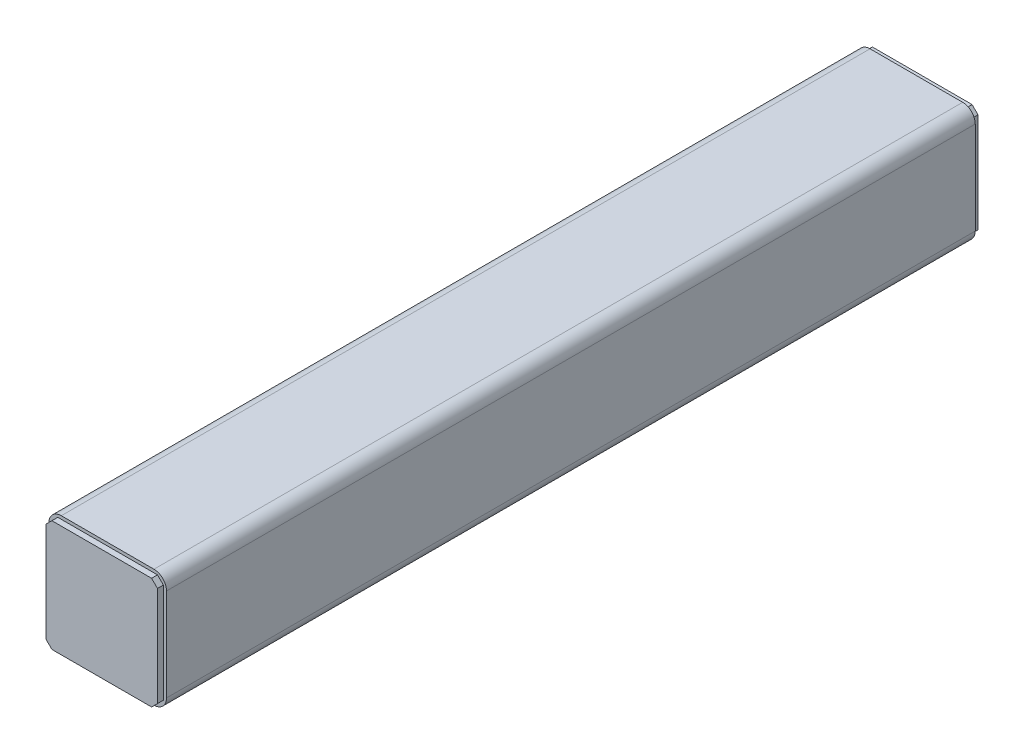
ISO-10303-21;
HEADER;
FILE_DESCRIPTION(('STEP AP214'),'2;1');
FILE_NAME('part.step','',(''),(''),'','','');
FILE_SCHEMA(('AUTOMOTIVE_DESIGN { 1 0 10303 214 1 1 1 1 }'));
ENDSEC;
DATA;
#1=APPLICATION_CONTEXT('core data for automotive mechanical design processes');
#2=APPLICATION_PROTOCOL_DEFINITION('international standard','automotive_design',2000,#1);
#3=PRODUCT_CONTEXT('',#1,'mechanical');
#4=PRODUCT('Part','Part','',(#3));
#5=PRODUCT_RELATED_PRODUCT_CATEGORY('part','',(#4));
#6=PRODUCT_DEFINITION_FORMATION('','',#4);
#7=PRODUCT_DEFINITION_CONTEXT('part definition',#1,'design');
#8=PRODUCT_DEFINITION('design','',#6,#7);
#9=PRODUCT_DEFINITION_SHAPE('','',#8);
#10=(LENGTH_UNIT() NAMED_UNIT(*) SI_UNIT(.MILLI.,.METRE.));
#11=(NAMED_UNIT(*) PLANE_ANGLE_UNIT() SI_UNIT($,.RADIAN.));
#12=(NAMED_UNIT(*) SI_UNIT($,.STERADIAN.) SOLID_ANGLE_UNIT());
#13=UNCERTAINTY_MEASURE_WITH_UNIT(LENGTH_MEASURE(1.E-05),#10,'distance_accuracy_value','');
#14=(GEOMETRIC_REPRESENTATION_CONTEXT(3) GLOBAL_UNCERTAINTY_ASSIGNED_CONTEXT((#13)) GLOBAL_UNIT_ASSIGNED_CONTEXT((#10,
#11,#12)) REPRESENTATION_CONTEXT('',''));
#15=CARTESIAN_POINT('',(0.,0.,0.));
#16=DIRECTION('',(0.,0.,1.));
#17=DIRECTION('',(1.,0.,0.));
#18=AXIS2_PLACEMENT_3D('',#15,#16,#17);
#19=CARTESIAN_POINT('',(28.4,25.4,-3.));
#20=DIRECTION('',(0.707106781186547,0.707106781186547,0.));
#21=DIRECTION('',(-0.707106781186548,0.707106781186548,0.));
#22=AXIS2_PLACEMENT_3D('',#19,#20,#21);
#23=PLANE('',#22);
#24=DIRECTION('',(-0.707106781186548,0.707106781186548,0.));
#25=VECTOR('',#24,1.);
#26=CARTESIAN_POINT('',(28.4,25.4,0.));
#27=LINE('',#26,#25);
#28=CARTESIAN_POINT('',(28.4,25.4,0.));
#29=VERTEX_POINT('',#28);
#30=CARTESIAN_POINT('',(25.4,28.4,0.));
#31=VERTEX_POINT('',#30);
#32=EDGE_CURVE('E192',#29,#31,#27,.T.);
#33=ORIENTED_EDGE('',*,*,#32,.F.);
#34=DIRECTION('',(0.,0.,1.));
#35=VECTOR('',#34,1.);
#36=CARTESIAN_POINT('',(28.4,25.4,-3.));
#37=LINE('',#36,#35);
#38=CARTESIAN_POINT('',(28.4,25.4,-3.));
#39=VERTEX_POINT('',#38);
#40=EDGE_CURVE('E13',#39,#29,#37,.T.);
#41=ORIENTED_EDGE('',*,*,#40,.F.);
#42=DIRECTION('',(-0.707106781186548,0.707106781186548,0.));
#43=VECTOR('',#42,1.);
#44=CARTESIAN_POINT('',(28.4,25.4,-3.));
#45=LINE('',#44,#43);
#46=CARTESIAN_POINT('',(25.4,28.4,-3.));
#47=VERTEX_POINT('',#46);
#48=EDGE_CURVE('E212',#39,#47,#45,.T.);
#49=ORIENTED_EDGE('',*,*,#48,.T.);
#50=DIRECTION('',(0.,0.,1.));
#51=VECTOR('',#50,1.);
#52=CARTESIAN_POINT('',(25.4,28.4,-3.));
#53=LINE('',#52,#51);
#54=EDGE_CURVE('E98',#47,#31,#53,.T.);
#55=ORIENTED_EDGE('',*,*,#54,.T.);
#56=EDGE_LOOP('',(#33,#41,#49,#55));
#57=FACE_BOUND('',#56,.T.);
#58=ADVANCED_FACE('F95',(#57),#23,.T.);
#59=CARTESIAN_POINT('',(28.4,-25.4,-3.));
#60=DIRECTION('',(1.,0.,0.));
#61=DIRECTION('',(0.,1.,0.));
#62=AXIS2_PLACEMENT_3D('',#59,#60,#61);
#63=PLANE('',#62);
#64=DIRECTION('',(0.,1.,0.));
#65=VECTOR('',#64,1.);
#66=CARTESIAN_POINT('',(28.4,-25.4,0.));
#67=LINE('',#66,#65);
#68=CARTESIAN_POINT('',(28.4,-25.4,0.));
#69=VERTEX_POINT('',#68);
#70=EDGE_CURVE('E210',#69,#29,#67,.T.);
#71=ORIENTED_EDGE('',*,*,#70,.F.);
#72=DIRECTION('',(0.,0.,1.));
#73=VECTOR('',#72,1.);
#74=CARTESIAN_POINT('',(28.4,-25.4,-3.));
#75=LINE('',#74,#73);
#76=CARTESIAN_POINT('',(28.4,-25.4,-3.));
#77=VERTEX_POINT('',#76);
#78=EDGE_CURVE('E104',#77,#69,#75,.T.);
#79=ORIENTED_EDGE('',*,*,#78,.F.);
#80=DIRECTION('',(0.,1.,0.));
#81=VECTOR('',#80,1.);
#82=CARTESIAN_POINT('',(28.4,-25.4,-3.));
#83=LINE('',#82,#81);
#84=EDGE_CURVE('E182',#77,#39,#83,.T.);
#85=ORIENTED_EDGE('',*,*,#84,.T.);
#86=ORIENTED_EDGE('',*,*,#40,.T.);
#87=EDGE_LOOP('',(#71,#79,#85,#86));
#88=FACE_BOUND('',#87,.T.);
#89=ADVANCED_FACE('F224',(#88),#63,.T.);
#90=CARTESIAN_POINT('',(25.4,-28.4,-3.));
#91=DIRECTION('',(0.707106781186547,-0.707106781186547,0.));
#92=DIRECTION('',(0.707106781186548,0.707106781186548,0.));
#93=AXIS2_PLACEMENT_3D('',#90,#91,#92);
#94=PLANE('',#93);
#95=DIRECTION('',(0.707106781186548,0.707106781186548,0.));
#96=VECTOR('',#95,1.);
#97=CARTESIAN_POINT('',(25.4,-28.4,0.));
#98=LINE('',#97,#96);
#99=CARTESIAN_POINT('',(25.4,-28.4,0.));
#100=VERTEX_POINT('',#99);
#101=EDGE_CURVE('E169',#100,#69,#98,.T.);
#102=ORIENTED_EDGE('',*,*,#101,.F.);
#103=DIRECTION('',(0.,0.,1.));
#104=VECTOR('',#103,1.);
#105=CARTESIAN_POINT('',(25.4,-28.4,-3.));
#106=LINE('',#105,#104);
#107=CARTESIAN_POINT('',(25.4,-28.4,-3.));
#108=VERTEX_POINT('',#107);
#109=EDGE_CURVE('E164',#108,#100,#106,.T.);
#110=ORIENTED_EDGE('',*,*,#109,.F.);
#111=DIRECTION('',(0.707106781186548,0.707106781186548,0.));
#112=VECTOR('',#111,1.);
#113=CARTESIAN_POINT('',(25.4,-28.4,-3.));
#114=LINE('',#113,#112);
#115=EDGE_CURVE('E167',#108,#77,#114,.T.);
#116=ORIENTED_EDGE('',*,*,#115,.T.);
#117=ORIENTED_EDGE('',*,*,#78,.T.);
#118=EDGE_LOOP('',(#102,#110,#116,#117));
#119=FACE_BOUND('',#118,.T.);
#120=ADVANCED_FACE('F166',(#119),#94,.T.);
#121=CARTESIAN_POINT('',(-25.4,-28.4,-3.));
#122=DIRECTION('',(0.,-1.,0.));
#123=DIRECTION('',(1.,0.,0.));
#124=AXIS2_PLACEMENT_3D('',#121,#122,#123);
#125=PLANE('',#124);
#126=DIRECTION('',(1.,0.,0.));
#127=VECTOR('',#126,1.);
#128=CARTESIAN_POINT('',(-25.4,-28.4,0.));
#129=LINE('',#128,#127);
#130=CARTESIAN_POINT('',(-25.4,-28.4,0.));
#131=VERTEX_POINT('',#130);
#132=EDGE_CURVE('E207',#131,#100,#129,.T.);
#133=ORIENTED_EDGE('',*,*,#132,.F.);
#134=DIRECTION('',(0.,0.,1.));
#135=VECTOR('',#134,1.);
#136=CARTESIAN_POINT('',(-25.4,-28.4,-3.));
#137=LINE('',#136,#135);
#138=CARTESIAN_POINT('',(-25.4,-28.4,-3.));
#139=VERTEX_POINT('',#138);
#140=EDGE_CURVE('E174',#139,#131,#137,.T.);
#141=ORIENTED_EDGE('',*,*,#140,.F.);
#142=DIRECTION('',(1.,0.,0.));
#143=VECTOR('',#142,1.);
#144=CARTESIAN_POINT('',(-25.4,-28.4,-3.));
#145=LINE('',#144,#143);
#146=EDGE_CURVE('E180',#139,#108,#145,.T.);
#147=ORIENTED_EDGE('',*,*,#146,.T.);
#148=ORIENTED_EDGE('',*,*,#109,.T.);
#149=EDGE_LOOP('',(#133,#141,#147,#148));
#150=FACE_BOUND('',#149,.T.);
#151=ADVANCED_FACE('F184',(#150),#125,.T.);
#152=CARTESIAN_POINT('',(-28.4,-25.4,-3.));
#153=DIRECTION('',(-0.707106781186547,-0.707106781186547,0.));
#154=DIRECTION('',(0.707106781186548,-0.707106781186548,0.));
#155=AXIS2_PLACEMENT_3D('',#152,#153,#154);
#156=PLANE('',#155);
#157=DIRECTION('',(0.707106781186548,-0.707106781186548,0.));
#158=VECTOR('',#157,1.);
#159=CARTESIAN_POINT('',(-28.4,-25.4,0.));
#160=LINE('',#159,#158);
#161=CARTESIAN_POINT('',(-28.4,-25.4,0.));
#162=VERTEX_POINT('',#161);
#163=EDGE_CURVE('E204',#162,#131,#160,.T.);
#164=ORIENTED_EDGE('',*,*,#163,.F.);
#165=DIRECTION('',(0.,0.,1.));
#166=VECTOR('',#165,1.);
#167=CARTESIAN_POINT('',(-28.4,-25.4,-3.));
#168=LINE('',#167,#166);
#169=CARTESIAN_POINT('',(-28.4,-25.4,-3.));
#170=VERTEX_POINT('',#169);
#171=EDGE_CURVE('E216',#170,#162,#168,.T.);
#172=ORIENTED_EDGE('',*,*,#171,.F.);
#173=DIRECTION('',(0.707106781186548,-0.707106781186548,0.));
#174=VECTOR('',#173,1.);
#175=CARTESIAN_POINT('',(-28.4,-25.4,-3.));
#176=LINE('',#175,#174);
#177=EDGE_CURVE('E185',#170,#139,#176,.T.);
#178=ORIENTED_EDGE('',*,*,#177,.T.);
#179=ORIENTED_EDGE('',*,*,#140,.T.);
#180=EDGE_LOOP('',(#164,#172,#178,#179));
#181=FACE_BOUND('',#180,.T.);
#182=ADVANCED_FACE('F237',(#181),#156,.T.);
#183=CARTESIAN_POINT('',(-28.4,25.4,-3.));
#184=DIRECTION('',(-1.,0.,0.));
#185=DIRECTION('',(0.,-1.,0.));
#186=AXIS2_PLACEMENT_3D('',#183,#184,#185);
#187=PLANE('',#186);
#188=DIRECTION('',(0.,-1.,0.));
#189=VECTOR('',#188,1.);
#190=CARTESIAN_POINT('',(-28.4,25.4,0.));
#191=LINE('',#190,#189);
#192=CARTESIAN_POINT('',(-28.4,25.4,0.));
#193=VERTEX_POINT('',#192);
#194=EDGE_CURVE('E201',#193,#162,#191,.T.);
#195=ORIENTED_EDGE('',*,*,#194,.F.);
#196=DIRECTION('',(0.,0.,1.));
#197=VECTOR('',#196,1.);
#198=CARTESIAN_POINT('',(-28.4,25.4,-3.));
#199=LINE('',#198,#197);
#200=CARTESIAN_POINT('',(-28.4,25.4,-3.));
#201=VERTEX_POINT('',#200);
#202=EDGE_CURVE('E218',#201,#193,#199,.T.);
#203=ORIENTED_EDGE('',*,*,#202,.F.);
#204=DIRECTION('',(0.,-1.,0.));
#205=VECTOR('',#204,1.);
#206=CARTESIAN_POINT('',(-28.4,25.4,-3.));
#207=LINE('',#206,#205);
#208=EDGE_CURVE('E187',#201,#170,#207,.T.);
#209=ORIENTED_EDGE('',*,*,#208,.T.);
#210=ORIENTED_EDGE('',*,*,#171,.T.);
#211=EDGE_LOOP('',(#195,#203,#209,#210));
#212=FACE_BOUND('',#211,.T.);
#213=ADVANCED_FACE('F240',(#212),#187,.T.);
#214=CARTESIAN_POINT('',(-25.4,28.4,-3.));
#215=DIRECTION('',(-0.707106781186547,0.707106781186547,0.));
#216=DIRECTION('',(-0.707106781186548,-0.707106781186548,0.));
#217=AXIS2_PLACEMENT_3D('',#214,#215,#216);
#218=PLANE('',#217);
#219=DIRECTION('',(-0.707106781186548,-0.707106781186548,0.));
#220=VECTOR('',#219,1.);
#221=CARTESIAN_POINT('',(-25.4,28.4,0.));
#222=LINE('',#221,#220);
#223=CARTESIAN_POINT('',(-25.4,28.4,0.));
#224=VERTEX_POINT('',#223);
#225=EDGE_CURVE('E198',#224,#193,#222,.T.);
#226=ORIENTED_EDGE('',*,*,#225,.F.);
#227=DIRECTION('',(0.,0.,1.));
#228=VECTOR('',#227,1.);
#229=CARTESIAN_POINT('',(-25.4,28.4,-3.));
#230=LINE('',#229,#228);
#231=CARTESIAN_POINT('',(-25.4,28.4,-3.));
#232=VERTEX_POINT('',#231);
#233=EDGE_CURVE('E219',#232,#224,#230,.T.);
#234=ORIENTED_EDGE('',*,*,#233,.F.);
#235=DIRECTION('',(-0.707106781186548,-0.707106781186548,0.));
#236=VECTOR('',#235,1.);
#237=CARTESIAN_POINT('',(-25.4,28.4,-3.));
#238=LINE('',#237,#236);
#239=EDGE_CURVE('E315',#232,#201,#238,.T.);
#240=ORIENTED_EDGE('',*,*,#239,.T.);
#241=ORIENTED_EDGE('',*,*,#202,.T.);
#242=EDGE_LOOP('',(#226,#234,#240,#241));
#243=FACE_BOUND('',#242,.T.);
#244=ADVANCED_FACE('F244',(#243),#218,.T.);
#245=CARTESIAN_POINT('',(25.4,28.4,-3.));
#246=DIRECTION('',(0.,1.,0.));
#247=DIRECTION('',(-1.,0.,0.));
#248=AXIS2_PLACEMENT_3D('',#245,#246,#247);
#249=PLANE('',#248);
#250=DIRECTION('',(-1.,0.,0.));
#251=VECTOR('',#250,1.);
#252=CARTESIAN_POINT('',(25.4,28.4,0.));
#253=LINE('',#252,#251);
#254=EDGE_CURVE('E195',#31,#224,#253,.T.);
#255=ORIENTED_EDGE('',*,*,#254,.F.);
#256=ORIENTED_EDGE('',*,*,#54,.F.);
#257=DIRECTION('',(-1.,0.,0.));
#258=VECTOR('',#257,1.);
#259=CARTESIAN_POINT('',(25.4,28.4,-3.));
#260=LINE('',#259,#258);
#261=EDGE_CURVE('E316',#47,#232,#260,.T.);
#262=ORIENTED_EDGE('',*,*,#261,.T.);
#263=ORIENTED_EDGE('',*,*,#233,.T.);
#264=EDGE_LOOP('',(#255,#256,#262,#263));
#265=FACE_BOUND('',#264,.T.);
#266=ADVANCED_FACE('F221',(#265),#249,.T.);
#267=CARTESIAN_POINT('',(0.,53.8,-3.));
#268=DIRECTION('',(0.,0.,1.));
#269=DIRECTION('',(1.,0.,0.));
#270=AXIS2_PLACEMENT_3D('',#267,#268,#269);
#271=PLANE('',#270);
#272=ORIENTED_EDGE('',*,*,#48,.F.);
#273=ORIENTED_EDGE('',*,*,#84,.F.);
#274=ORIENTED_EDGE('',*,*,#115,.F.);
#275=ORIENTED_EDGE('',*,*,#146,.F.);
#276=ORIENTED_EDGE('',*,*,#177,.F.);
#277=ORIENTED_EDGE('',*,*,#208,.F.);
#278=ORIENTED_EDGE('',*,*,#239,.F.);
#279=ORIENTED_EDGE('',*,*,#261,.F.);
#280=EDGE_LOOP('',(#272,#273,#274,#275,#276,#277,#278,#279));
#281=FACE_BOUND('',#280,.T.);
#282=ADVANCED_FACE('F178',(#281),#271,.F.);
#283=CARTESIAN_POINT('',(0.,53.8,0.));
#284=DIRECTION('',(0.,0.,1.));
#285=DIRECTION('',(1.,0.,0.));
#286=AXIS2_PLACEMENT_3D('',#283,#284,#285);
#287=PLANE('',#286);
#288=ORIENTED_EDGE('',*,*,#32,.T.);
#289=ORIENTED_EDGE('',*,*,#254,.T.);
#290=ORIENTED_EDGE('',*,*,#225,.T.);
#291=ORIENTED_EDGE('',*,*,#194,.T.);
#292=ORIENTED_EDGE('',*,*,#163,.T.);
#293=ORIENTED_EDGE('',*,*,#132,.T.);
#294=ORIENTED_EDGE('',*,*,#101,.T.);
#295=ORIENTED_EDGE('',*,*,#70,.T.);
#296=EDGE_LOOP('',(#288,#289,#290,#291,#292,#293,#294,#295));
#297=FACE_BOUND('',#296,.T.);
#298=ADVANCED_FACE('F223',(#297),#287,.T.);
#299=CLOSED_SHELL('',(#58,#89,#120,#151,#182,#213,#244,#266,#282,#298));
#300=MANIFOLD_SOLID_BREP('B2',#299);
#301=CARTESIAN_POINT('',(25.4,28.4,-415.));
#302=DIRECTION('',(0.707106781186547,0.707106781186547,0.));
#303=DIRECTION('',(-0.707106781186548,0.707106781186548,0.));
#304=AXIS2_PLACEMENT_3D('',#301,#302,#303);
#305=PLANE('',#304);
#306=DIRECTION('',(0.707106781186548,-0.707106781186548,0.));
#307=VECTOR('',#306,1.);
#308=CARTESIAN_POINT('',(25.4,28.4,-418.));
#309=LINE('',#308,#307);
#310=CARTESIAN_POINT('',(25.4,28.4,-418.));
#311=VERTEX_POINT('',#310);
#312=CARTESIAN_POINT('',(28.4,25.4,-418.));
#313=VERTEX_POINT('',#312);
#314=EDGE_CURVE('E428',#311,#313,#309,.T.);
#315=ORIENTED_EDGE('',*,*,#314,.F.);
#316=DIRECTION('',(0.,0.,-1.));
#317=VECTOR('',#316,1.);
#318=CARTESIAN_POINT('',(25.4,28.4,-415.));
#319=LINE('',#318,#317);
#320=CARTESIAN_POINT('',(25.4,28.4,-415.));
#321=VERTEX_POINT('',#320);
#322=EDGE_CURVE('E93',#321,#311,#319,.T.);
#323=ORIENTED_EDGE('',*,*,#322,.F.);
#324=DIRECTION('',(0.707106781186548,-0.707106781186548,0.));
#325=VECTOR('',#324,1.);
#326=CARTESIAN_POINT('',(25.4,28.4,-415.));
#327=LINE('',#326,#325);
#328=CARTESIAN_POINT('',(28.4,25.4,-415.));
#329=VERTEX_POINT('',#328);
#330=EDGE_CURVE('E448',#321,#329,#327,.T.);
#331=ORIENTED_EDGE('',*,*,#330,.T.);
#332=DIRECTION('',(0.,0.,-1.));
#333=VECTOR('',#332,1.);
#334=CARTESIAN_POINT('',(28.4,25.4,-415.));
#335=LINE('',#334,#333);
#336=EDGE_CURVE('E334',#329,#313,#335,.T.);
#337=ORIENTED_EDGE('',*,*,#336,.T.);
#338=EDGE_LOOP('',(#315,#323,#331,#337));
#339=FACE_BOUND('',#338,.T.);
#340=ADVANCED_FACE('F331',(#339),#305,.T.);
#341=CARTESIAN_POINT('',(-25.4,28.4,-415.));
#342=DIRECTION('',(0.,1.,0.));
#343=DIRECTION('',(-1.,0.,0.));
#344=AXIS2_PLACEMENT_3D('',#341,#342,#343);
#345=PLANE('',#344);
#346=DIRECTION('',(1.,0.,0.));
#347=VECTOR('',#346,1.);
#348=CARTESIAN_POINT('',(-25.4,28.4,-418.));
#349=LINE('',#348,#347);
#350=CARTESIAN_POINT('',(-25.4,28.4,-418.));
#351=VERTEX_POINT('',#350);
#352=EDGE_CURVE('E446',#351,#311,#349,.T.);
#353=ORIENTED_EDGE('',*,*,#352,.F.);
#354=DIRECTION('',(0.,0.,-1.));
#355=VECTOR('',#354,1.);
#356=CARTESIAN_POINT('',(-25.4,28.4,-415.));
#357=LINE('',#356,#355);
#358=CARTESIAN_POINT('',(-25.4,28.4,-415.));
#359=VERTEX_POINT('',#358);
#360=EDGE_CURVE('E340',#359,#351,#357,.T.);
#361=ORIENTED_EDGE('',*,*,#360,.F.);
#362=DIRECTION('',(1.,0.,0.));
#363=VECTOR('',#362,1.);
#364=CARTESIAN_POINT('',(-25.4,28.4,-415.));
#365=LINE('',#364,#363);
#366=EDGE_CURVE('E418',#359,#321,#365,.T.);
#367=ORIENTED_EDGE('',*,*,#366,.T.);
#368=ORIENTED_EDGE('',*,*,#322,.T.);
#369=EDGE_LOOP('',(#353,#361,#367,#368));
#370=FACE_BOUND('',#369,.T.);
#371=ADVANCED_FACE('F460',(#370),#345,.T.);
#372=CARTESIAN_POINT('',(-28.4,25.4,-415.));
#373=DIRECTION('',(-0.707106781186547,0.707106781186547,0.));
#374=DIRECTION('',(-0.707106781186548,-0.707106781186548,0.));
#375=AXIS2_PLACEMENT_3D('',#372,#373,#374);
#376=PLANE('',#375);
#377=DIRECTION('',(0.707106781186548,0.707106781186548,0.));
#378=VECTOR('',#377,1.);
#379=CARTESIAN_POINT('',(-28.4,25.4,-418.));
#380=LINE('',#379,#378);
#381=CARTESIAN_POINT('',(-28.4,25.4,-418.));
#382=VERTEX_POINT('',#381);
#383=EDGE_CURVE('E405',#382,#351,#380,.T.);
#384=ORIENTED_EDGE('',*,*,#383,.F.);
#385=DIRECTION('',(0.,0.,-1.));
#386=VECTOR('',#385,1.);
#387=CARTESIAN_POINT('',(-28.4,25.4,-415.));
#388=LINE('',#387,#386);
#389=CARTESIAN_POINT('',(-28.4,25.4,-415.));
#390=VERTEX_POINT('',#389);
#391=EDGE_CURVE('E400',#390,#382,#388,.T.);
#392=ORIENTED_EDGE('',*,*,#391,.F.);
#393=DIRECTION('',(0.707106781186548,0.707106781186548,0.));
#394=VECTOR('',#393,1.);
#395=CARTESIAN_POINT('',(-28.4,25.4,-415.));
#396=LINE('',#395,#394);
#397=EDGE_CURVE('E403',#390,#359,#396,.T.);
#398=ORIENTED_EDGE('',*,*,#397,.T.);
#399=ORIENTED_EDGE('',*,*,#360,.T.);
#400=EDGE_LOOP('',(#384,#392,#398,#399));
#401=FACE_BOUND('',#400,.T.);
#402=ADVANCED_FACE('F402',(#401),#376,.T.);
#403=CARTESIAN_POINT('',(-28.4,-25.4,-415.));
#404=DIRECTION('',(-1.,0.,0.));
#405=DIRECTION('',(0.,0.,1.));
#406=AXIS2_PLACEMENT_3D('',#403,#404,#405);
#407=PLANE('',#406);
#408=DIRECTION('',(0.,1.,0.));
#409=VECTOR('',#408,1.);
#410=CARTESIAN_POINT('',(-28.4,-25.4,-418.));
#411=LINE('',#410,#409);
#412=CARTESIAN_POINT('',(-28.4,-25.4,-418.));
#413=VERTEX_POINT('',#412);
#414=EDGE_CURVE('E443',#413,#382,#411,.T.);
#415=ORIENTED_EDGE('',*,*,#414,.F.);
#416=DIRECTION('',(0.,0.,-1.));
#417=VECTOR('',#416,1.);
#418=CARTESIAN_POINT('',(-28.4,-25.4,-415.));
#419=LINE('',#418,#417);
#420=CARTESIAN_POINT('',(-28.4,-25.4,-415.));
#421=VERTEX_POINT('',#420);
#422=EDGE_CURVE('E410',#421,#413,#419,.T.);
#423=ORIENTED_EDGE('',*,*,#422,.F.);
#424=DIRECTION('',(0.,1.,0.));
#425=VECTOR('',#424,1.);
#426=CARTESIAN_POINT('',(-28.4,-25.4,-415.));
#427=LINE('',#426,#425);
#428=EDGE_CURVE('E416',#421,#390,#427,.T.);
#429=ORIENTED_EDGE('',*,*,#428,.T.);
#430=ORIENTED_EDGE('',*,*,#391,.T.);
#431=EDGE_LOOP('',(#415,#423,#429,#430));
#432=FACE_BOUND('',#431,.T.);
#433=ADVANCED_FACE('F420',(#432),#407,.T.);
#434=CARTESIAN_POINT('',(-25.4,-28.4,-415.));
#435=DIRECTION('',(-0.707106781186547,-0.707106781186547,0.));
#436=DIRECTION('',(0.707106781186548,-0.707106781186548,0.));
#437=AXIS2_PLACEMENT_3D('',#434,#435,#436);
#438=PLANE('',#437);
#439=DIRECTION('',(-0.707106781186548,0.707106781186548,0.));
#440=VECTOR('',#439,1.);
#441=CARTESIAN_POINT('',(-25.4,-28.4,-418.));
#442=LINE('',#441,#440);
#443=CARTESIAN_POINT('',(-25.4,-28.4,-418.));
#444=VERTEX_POINT('',#443);
#445=EDGE_CURVE('E440',#444,#413,#442,.T.);
#446=ORIENTED_EDGE('',*,*,#445,.F.);
#447=DIRECTION('',(0.,0.,-1.));
#448=VECTOR('',#447,1.);
#449=CARTESIAN_POINT('',(-25.4,-28.4,-415.));
#450=LINE('',#449,#448);
#451=CARTESIAN_POINT('',(-25.4,-28.4,-415.));
#452=VERTEX_POINT('',#451);
#453=EDGE_CURVE('E452',#452,#444,#450,.T.);
#454=ORIENTED_EDGE('',*,*,#453,.F.);
#455=DIRECTION('',(-0.707106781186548,0.707106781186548,0.));
#456=VECTOR('',#455,1.);
#457=CARTESIAN_POINT('',(-25.4,-28.4,-415.));
#458=LINE('',#457,#456);
#459=EDGE_CURVE('E421',#452,#421,#458,.T.);
#460=ORIENTED_EDGE('',*,*,#459,.T.);
#461=ORIENTED_EDGE('',*,*,#422,.T.);
#462=EDGE_LOOP('',(#446,#454,#460,#461));
#463=FACE_BOUND('',#462,.T.);
#464=ADVANCED_FACE('F473',(#463),#438,.T.);
#465=CARTESIAN_POINT('',(25.4,-28.4,-415.));
#466=DIRECTION('',(0.,-1.,0.));
#467=DIRECTION('',(1.,0.,0.));
#468=AXIS2_PLACEMENT_3D('',#465,#466,#467);
#469=PLANE('',#468);
#470=DIRECTION('',(-1.,0.,0.));
#471=VECTOR('',#470,1.);
#472=CARTESIAN_POINT('',(25.4,-28.4,-418.));
#473=LINE('',#472,#471);
#474=CARTESIAN_POINT('',(25.4,-28.4,-418.));
#475=VERTEX_POINT('',#474);
#476=EDGE_CURVE('E437',#475,#444,#473,.T.);
#477=ORIENTED_EDGE('',*,*,#476,.F.);
#478=DIRECTION('',(0.,0.,-1.));
#479=VECTOR('',#478,1.);
#480=CARTESIAN_POINT('',(25.4,-28.4,-415.));
#481=LINE('',#480,#479);
#482=CARTESIAN_POINT('',(25.4,-28.4,-415.));
#483=VERTEX_POINT('',#482);
#484=EDGE_CURVE('E454',#483,#475,#481,.T.);
#485=ORIENTED_EDGE('',*,*,#484,.F.);
#486=DIRECTION('',(-1.,0.,0.));
#487=VECTOR('',#486,1.);
#488=CARTESIAN_POINT('',(25.4,-28.4,-415.));
#489=LINE('',#488,#487);
#490=EDGE_CURVE('E423',#483,#452,#489,.T.);
#491=ORIENTED_EDGE('',*,*,#490,.T.);
#492=ORIENTED_EDGE('',*,*,#453,.T.);
#493=EDGE_LOOP('',(#477,#485,#491,#492));
#494=FACE_BOUND('',#493,.T.);
#495=ADVANCED_FACE('F476',(#494),#469,.T.);
#496=CARTESIAN_POINT('',(28.4,-25.4,-415.));
#497=DIRECTION('',(0.707106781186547,-0.707106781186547,0.));
#498=DIRECTION('',(0.707106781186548,0.707106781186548,0.));
#499=AXIS2_PLACEMENT_3D('',#496,#497,#498);
#500=PLANE('',#499);
#501=DIRECTION('',(-0.707106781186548,-0.707106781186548,0.));
#502=VECTOR('',#501,1.);
#503=CARTESIAN_POINT('',(28.4,-25.4,-418.));
#504=LINE('',#503,#502);
#505=CARTESIAN_POINT('',(28.4,-25.4,-418.));
#506=VERTEX_POINT('',#505);
#507=EDGE_CURVE('E434',#506,#475,#504,.T.);
#508=ORIENTED_EDGE('',*,*,#507,.F.);
#509=DIRECTION('',(0.,0.,-1.));
#510=VECTOR('',#509,1.);
#511=CARTESIAN_POINT('',(28.4,-25.4,-415.));
#512=LINE('',#511,#510);
#513=CARTESIAN_POINT('',(28.4,-25.4,-415.));
#514=VERTEX_POINT('',#513);
#515=EDGE_CURVE('E455',#514,#506,#512,.T.);
#516=ORIENTED_EDGE('',*,*,#515,.F.);
#517=DIRECTION('',(-0.707106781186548,-0.707106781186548,0.));
#518=VECTOR('',#517,1.);
#519=CARTESIAN_POINT('',(28.4,-25.4,-415.));
#520=LINE('',#519,#518);
#521=EDGE_CURVE('E551',#514,#483,#520,.T.);
#522=ORIENTED_EDGE('',*,*,#521,.T.);
#523=ORIENTED_EDGE('',*,*,#484,.T.);
#524=EDGE_LOOP('',(#508,#516,#522,#523));
#525=FACE_BOUND('',#524,.T.);
#526=ADVANCED_FACE('F480',(#525),#500,.T.);
#527=CARTESIAN_POINT('',(28.4,25.4,-415.));
#528=DIRECTION('',(1.,0.,0.));
#529=DIRECTION('',(0.,1.,0.));
#530=AXIS2_PLACEMENT_3D('',#527,#528,#529);
#531=PLANE('',#530);
#532=DIRECTION('',(0.,-1.,0.));
#533=VECTOR('',#532,1.);
#534=CARTESIAN_POINT('',(28.4,25.4,-418.));
#535=LINE('',#534,#533);
#536=EDGE_CURVE('E431',#313,#506,#535,.T.);
#537=ORIENTED_EDGE('',*,*,#536,.F.);
#538=ORIENTED_EDGE('',*,*,#336,.F.);
#539=DIRECTION('',(0.,-1.,0.));
#540=VECTOR('',#539,1.);
#541=CARTESIAN_POINT('',(28.4,25.4,-415.));
#542=LINE('',#541,#540);
#543=EDGE_CURVE('E552',#329,#514,#542,.T.);
#544=ORIENTED_EDGE('',*,*,#543,.T.);
#545=ORIENTED_EDGE('',*,*,#515,.T.);
#546=EDGE_LOOP('',(#537,#538,#544,#545));
#547=FACE_BOUND('',#546,.T.);
#548=ADVANCED_FACE('F457',(#547),#531,.T.);
#549=CARTESIAN_POINT('',(53.8,0.,-415.));
#550=DIRECTION('',(0.,0.,-1.));
#551=DIRECTION('',(-1.,0.,0.));
#552=AXIS2_PLACEMENT_3D('',#549,#550,#551);
#553=PLANE('',#552);
#554=ORIENTED_EDGE('',*,*,#330,.F.);
#555=ORIENTED_EDGE('',*,*,#366,.F.);
#556=ORIENTED_EDGE('',*,*,#397,.F.);
#557=ORIENTED_EDGE('',*,*,#428,.F.);
#558=ORIENTED_EDGE('',*,*,#459,.F.);
#559=ORIENTED_EDGE('',*,*,#490,.F.);
#560=ORIENTED_EDGE('',*,*,#521,.F.);
#561=ORIENTED_EDGE('',*,*,#543,.F.);
#562=EDGE_LOOP('',(#554,#555,#556,#557,#558,#559,#560,#561));
#563=FACE_BOUND('',#562,.T.);
#564=ADVANCED_FACE('F414',(#563),#553,.F.);
#565=CARTESIAN_POINT('',(53.8,0.,-418.));
#566=DIRECTION('',(0.,0.,-1.));
#567=DIRECTION('',(-1.,0.,0.));
#568=AXIS2_PLACEMENT_3D('',#565,#566,#567);
#569=PLANE('',#568);
#570=ORIENTED_EDGE('',*,*,#314,.T.);
#571=ORIENTED_EDGE('',*,*,#536,.T.);
#572=ORIENTED_EDGE('',*,*,#507,.T.);
#573=ORIENTED_EDGE('',*,*,#476,.T.);
#574=ORIENTED_EDGE('',*,*,#445,.T.);
#575=ORIENTED_EDGE('',*,*,#414,.T.);
#576=ORIENTED_EDGE('',*,*,#383,.T.);
#577=ORIENTED_EDGE('',*,*,#352,.T.);
#578=EDGE_LOOP('',(#570,#571,#572,#573,#574,#575,#576,#577));
#579=FACE_BOUND('',#578,.T.);
#580=ADVANCED_FACE('F459',(#579),#569,.T.);
#581=CLOSED_SHELL('',(#340,#371,#402,#433,#464,#495,#526,#548,#564,#580));
#582=MANIFOLD_SOLID_BREP('B7',#581);
#583=CARTESIAN_POINT('',(23.6,23.6,-418.));
#584=DIRECTION('',(0.,0.,1.));
#585=DIRECTION('',(1.,0.,0.));
#586=AXIS2_PLACEMENT_3D('',#583,#584,#585);
#587=CYLINDRICAL_SURFACE('',#586,6.4);
#588=CARTESIAN_POINT('',(23.6,23.6,-3.));
#589=DIRECTION('',(0.,0.,1.));
#590=DIRECTION('',(1.,0.,0.));
#591=AXIS2_PLACEMENT_3D('',#588,#589,#590);
#592=CIRCLE('',#591,6.4);
#593=CARTESIAN_POINT('',(23.6,30.,-3.));
#594=VERTEX_POINT('',#593);
#595=CARTESIAN_POINT('',(30.,23.6,-3.));
#596=VERTEX_POINT('',#595);
#597=EDGE_CURVE('E761',#594,#596,#592,.F.);
#598=ORIENTED_EDGE('',*,*,#597,.T.);
#599=DIRECTION('',(0.,0.,1.));
#600=VECTOR('',#599,1.);
#601=CARTESIAN_POINT('',(30.,23.6,-418.));
#602=LINE('',#601,#600);
#603=CARTESIAN_POINT('',(30.,23.6,-415.));
#604=VERTEX_POINT('',#603);
#605=EDGE_CURVE('E329',#604,#596,#602,.T.);
#606=ORIENTED_EDGE('',*,*,#605,.F.);
#607=CARTESIAN_POINT('',(23.6,23.6,-415.));
#608=DIRECTION('',(0.,0.,-1.));
#609=DIRECTION('',(-1.,0.,0.));
#610=AXIS2_PLACEMENT_3D('',#607,#608,#609);
#611=CIRCLE('',#610,6.4);
#612=CARTESIAN_POINT('',(23.6,30.,-415.));
#613=VERTEX_POINT('',#612);
#614=EDGE_CURVE('E708',#613,#604,#611,.T.);
#615=ORIENTED_EDGE('',*,*,#614,.F.);
#616=DIRECTION('',(0.,0.,1.));
#617=VECTOR('',#616,1.);
#618=CARTESIAN_POINT('',(23.6,30.,-418.));
#619=LINE('',#618,#617);
#620=EDGE_CURVE('E793',#613,#594,#619,.T.);
#621=ORIENTED_EDGE('',*,*,#620,.T.);
#622=EDGE_LOOP('',(#598,#606,#615,#621));
#623=FACE_BOUND('',#622,.T.);
#624=ADVANCED_FACE('F558',(#623),#587,.T.);
#625=CARTESIAN_POINT('',(30.,23.6,-418.));
#626=DIRECTION('',(-1.,0.,0.));
#627=DIRECTION('',(0.,-1.,0.));
#628=AXIS2_PLACEMENT_3D('',#625,#626,#627);
#629=PLANE('',#628);
#630=DIRECTION('',(0.,1.,0.));
#631=VECTOR('',#630,1.);
#632=CARTESIAN_POINT('',(30.,23.6,-3.));
#633=LINE('',#632,#631);
#634=CARTESIAN_POINT('',(30.,-23.6,-3.));
#635=VERTEX_POINT('',#634);
#636=EDGE_CURVE('E764',#596,#635,#633,.F.);
#637=ORIENTED_EDGE('',*,*,#636,.T.);
#638=DIRECTION('',(0.,0.,1.));
#639=VECTOR('',#638,1.);
#640=CARTESIAN_POINT('',(30.,-23.6,-418.));
#641=LINE('',#640,#639);
#642=CARTESIAN_POINT('',(30.,-23.6,-415.));
#643=VERTEX_POINT('',#642);
#644=EDGE_CURVE('E568',#643,#635,#641,.T.);
#645=ORIENTED_EDGE('',*,*,#644,.F.);
#646=DIRECTION('',(0.,-1.,0.));
#647=VECTOR('',#646,1.);
#648=CARTESIAN_POINT('',(30.,23.6,-415.));
#649=LINE('',#648,#647);
#650=EDGE_CURVE('E710',#604,#643,#649,.T.);
#651=ORIENTED_EDGE('',*,*,#650,.F.);
#652=ORIENTED_EDGE('',*,*,#605,.T.);
#653=EDGE_LOOP('',(#637,#645,#651,#652));
#654=FACE_BOUND('',#653,.T.);
#655=ADVANCED_FACE('F845',(#654),#629,.F.);
#656=CARTESIAN_POINT('',(23.6,-23.6,-418.));
#657=DIRECTION('',(0.,0.,1.));
#658=DIRECTION('',(1.,0.,0.));
#659=AXIS2_PLACEMENT_3D('',#656,#657,#658);
#660=CYLINDRICAL_SURFACE('',#659,6.4);
#661=CARTESIAN_POINT('',(23.6,-23.6,-3.));
#662=DIRECTION('',(0.,0.,1.));
#663=DIRECTION('',(1.,0.,0.));
#664=AXIS2_PLACEMENT_3D('',#661,#662,#663);
#665=CIRCLE('',#664,6.4);
#666=CARTESIAN_POINT('',(23.6,-30.,-3.));
#667=VERTEX_POINT('',#666);
#668=EDGE_CURVE('E766',#635,#667,#665,.F.);
#669=ORIENTED_EDGE('',*,*,#668,.T.);
#670=DIRECTION('',(0.,0.,1.));
#671=VECTOR('',#670,1.);
#672=CARTESIAN_POINT('',(23.6,-30.,-418.));
#673=LINE('',#672,#671);
#674=CARTESIAN_POINT('',(23.6,-30.,-415.));
#675=VERTEX_POINT('',#674);
#676=EDGE_CURVE('E801',#675,#667,#673,.T.);
#677=ORIENTED_EDGE('',*,*,#676,.F.);
#678=CARTESIAN_POINT('',(23.6,-23.6,-415.));
#679=DIRECTION('',(0.,0.,-1.));
#680=DIRECTION('',(-1.,0.,0.));
#681=AXIS2_PLACEMENT_3D('',#678,#679,#680);
#682=CIRCLE('',#681,6.4);
#683=EDGE_CURVE('E737',#643,#675,#682,.T.);
#684=ORIENTED_EDGE('',*,*,#683,.F.);
#685=ORIENTED_EDGE('',*,*,#644,.T.);
#686=EDGE_LOOP('',(#669,#677,#684,#685));
#687=FACE_BOUND('',#686,.T.);
#688=ADVANCED_FACE('F850',(#687),#660,.T.);
#689=CARTESIAN_POINT('',(-23.6,-30.,-418.));
#690=DIRECTION('',(0.,1.,0.));
#691=DIRECTION('',(-1.,0.,0.));
#692=AXIS2_PLACEMENT_3D('',#689,#690,#691);
#693=PLANE('',#692);
#694=DIRECTION('',(1.,0.,0.));
#695=VECTOR('',#694,1.);
#696=CARTESIAN_POINT('',(-23.6,-30.,-3.));
#697=LINE('',#696,#695);
#698=CARTESIAN_POINT('',(-23.6,-30.,-3.));
#699=VERTEX_POINT('',#698);
#700=EDGE_CURVE('E768',#667,#699,#697,.F.);
#701=ORIENTED_EDGE('',*,*,#700,.T.);
#702=DIRECTION('',(0.,0.,1.));
#703=VECTOR('',#702,1.);
#704=CARTESIAN_POINT('',(-23.6,-30.,-418.));
#705=LINE('',#704,#703);
#706=CARTESIAN_POINT('',(-23.6,-30.,-415.));
#707=VERTEX_POINT('',#706);
#708=EDGE_CURVE('E798',#707,#699,#705,.T.);
#709=ORIENTED_EDGE('',*,*,#708,.F.);
#710=DIRECTION('',(-1.,0.,0.));
#711=VECTOR('',#710,1.);
#712=CARTESIAN_POINT('',(-23.6,-30.,-415.));
#713=LINE('',#712,#711);
#714=EDGE_CURVE('E735',#675,#707,#713,.T.);
#715=ORIENTED_EDGE('',*,*,#714,.F.);
#716=ORIENTED_EDGE('',*,*,#676,.T.);
#717=EDGE_LOOP('',(#701,#709,#715,#716));
#718=FACE_BOUND('',#717,.T.);
#719=ADVANCED_FACE('F856',(#718),#693,.F.);
#720=CARTESIAN_POINT('',(-23.6,-23.6,-418.));
#721=DIRECTION('',(0.,0.,1.));
#722=DIRECTION('',(1.,0.,0.));
#723=AXIS2_PLACEMENT_3D('',#720,#721,#722);
#724=CYLINDRICAL_SURFACE('',#723,6.4);
#725=CARTESIAN_POINT('',(-23.6,-23.6,-3.));
#726=DIRECTION('',(0.,0.,1.));
#727=DIRECTION('',(1.,0.,0.));
#728=AXIS2_PLACEMENT_3D('',#725,#726,#727);
#729=CIRCLE('',#728,6.4);
#730=CARTESIAN_POINT('',(-30.,-23.6,-3.));
#731=VERTEX_POINT('',#730);
#732=EDGE_CURVE('E770',#699,#731,#729,.F.);
#733=ORIENTED_EDGE('',*,*,#732,.T.);
#734=DIRECTION('',(0.,0.,1.));
#735=VECTOR('',#734,1.);
#736=CARTESIAN_POINT('',(-30.,-23.6,-418.));
#737=LINE('',#736,#735);
#738=CARTESIAN_POINT('',(-30.,-23.6,-415.));
#739=VERTEX_POINT('',#738);
#740=EDGE_CURVE('E782',#739,#731,#737,.T.);
#741=ORIENTED_EDGE('',*,*,#740,.F.);
#742=CARTESIAN_POINT('',(-23.6,-23.6,-415.));
#743=DIRECTION('',(0.,0.,-1.));
#744=DIRECTION('',(-1.,0.,0.));
#745=AXIS2_PLACEMENT_3D('',#742,#743,#744);
#746=CIRCLE('',#745,6.4);
#747=EDGE_CURVE('E733',#707,#739,#746,.T.);
#748=ORIENTED_EDGE('',*,*,#747,.F.);
#749=ORIENTED_EDGE('',*,*,#708,.T.);
#750=EDGE_LOOP('',(#733,#741,#748,#749));
#751=FACE_BOUND('',#750,.T.);
#752=ADVANCED_FACE('F860',(#751),#724,.T.);
#753=CARTESIAN_POINT('',(-30.,-23.6,-418.));
#754=DIRECTION('',(1.,0.,0.));
#755=DIRECTION('',(0.,1.,0.));
#756=AXIS2_PLACEMENT_3D('',#753,#754,#755);
#757=PLANE('',#756);
#758=DIRECTION('',(0.,-1.,0.));
#759=VECTOR('',#758,1.);
#760=CARTESIAN_POINT('',(-30.,-23.6,-3.));
#761=LINE('',#760,#759);
#762=CARTESIAN_POINT('',(-30.,23.6,-3.));
#763=VERTEX_POINT('',#762);
#764=EDGE_CURVE('E772',#731,#763,#761,.F.);
#765=ORIENTED_EDGE('',*,*,#764,.T.);
#766=DIRECTION('',(0.,0.,1.));
#767=VECTOR('',#766,1.);
#768=CARTESIAN_POINT('',(-30.,23.6,-418.));
#769=LINE('',#768,#767);
#770=CARTESIAN_POINT('',(-30.,23.6,-415.));
#771=VERTEX_POINT('',#770);
#772=EDGE_CURVE('E779',#771,#763,#769,.T.);
#773=ORIENTED_EDGE('',*,*,#772,.F.);
#774=DIRECTION('',(0.,1.,0.));
#775=VECTOR('',#774,1.);
#776=CARTESIAN_POINT('',(-30.,-23.6,-415.));
#777=LINE('',#776,#775);
#778=EDGE_CURVE('E731',#739,#771,#777,.T.);
#779=ORIENTED_EDGE('',*,*,#778,.F.);
#780=ORIENTED_EDGE('',*,*,#740,.T.);
#781=EDGE_LOOP('',(#765,#773,#779,#780));
#782=FACE_BOUND('',#781,.T.);
#783=ADVANCED_FACE('F777',(#782),#757,.F.);
#784=CARTESIAN_POINT('',(-23.6,23.6,-418.));
#785=DIRECTION('',(0.,0.,1.));
#786=DIRECTION('',(1.,0.,0.));
#787=AXIS2_PLACEMENT_3D('',#784,#785,#786);
#788=CYLINDRICAL_SURFACE('',#787,6.4);
#789=CARTESIAN_POINT('',(-23.6,23.6,-3.));
#790=DIRECTION('',(0.,0.,1.));
#791=DIRECTION('',(1.,0.,0.));
#792=AXIS2_PLACEMENT_3D('',#789,#790,#791);
#793=CIRCLE('',#792,6.4);
#794=CARTESIAN_POINT('',(-23.6,30.,-3.));
#795=VERTEX_POINT('',#794);
#796=EDGE_CURVE('E650',#763,#795,#793,.F.);
#797=ORIENTED_EDGE('',*,*,#796,.T.);
#798=DIRECTION('',(0.,0.,1.));
#799=VECTOR('',#798,1.);
#800=CARTESIAN_POINT('',(-23.6,30.,-418.));
#801=LINE('',#800,#799);
#802=CARTESIAN_POINT('',(-23.6,30.,-415.));
#803=VERTEX_POINT('',#802);
#804=EDGE_CURVE('E786',#803,#795,#801,.T.);
#805=ORIENTED_EDGE('',*,*,#804,.F.);
#806=CARTESIAN_POINT('',(-23.6,23.6,-415.));
#807=DIRECTION('',(0.,0.,-1.));
#808=DIRECTION('',(-1.,0.,0.));
#809=AXIS2_PLACEMENT_3D('',#806,#807,#808);
#810=CIRCLE('',#809,6.4);
#811=EDGE_CURVE('E729',#771,#803,#810,.T.);
#812=ORIENTED_EDGE('',*,*,#811,.F.);
#813=ORIENTED_EDGE('',*,*,#772,.T.);
#814=EDGE_LOOP('',(#797,#805,#812,#813));
#815=FACE_BOUND('',#814,.T.);
#816=ADVANCED_FACE('F785',(#815),#788,.T.);
#817=CARTESIAN_POINT('',(23.6,-23.6,-418.));
#818=DIRECTION('',(0.,0.,1.));
#819=DIRECTION('',(1.,0.,0.));
#820=AXIS2_PLACEMENT_3D('',#817,#818,#819);
#821=CYLINDRICAL_SURFACE('',#820,3.20000000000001);
#822=CARTESIAN_POINT('',(23.6,-23.6,-3.));
#823=DIRECTION('',(0.,0.,1.));
#824=DIRECTION('',(1.,0.,0.));
#825=AXIS2_PLACEMENT_3D('',#822,#823,#824);
#826=CIRCLE('',#825,3.20000000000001);
#827=CARTESIAN_POINT('',(26.8,-23.6,-3.));
#828=VERTEX_POINT('',#827);
#829=CARTESIAN_POINT('',(23.6,-26.8,-3.));
#830=VERTEX_POINT('',#829);
#831=EDGE_CURVE('E740',#828,#830,#826,.F.);
#832=ORIENTED_EDGE('',*,*,#831,.F.);
#833=DIRECTION('',(0.,0.,1.));
#834=VECTOR('',#833,1.);
#835=CARTESIAN_POINT('',(26.8,-23.6,-418.));
#836=LINE('',#835,#834);
#837=CARTESIAN_POINT('',(26.8,-23.6,-415.));
#838=VERTEX_POINT('',#837);
#839=EDGE_CURVE('E661',#838,#828,#836,.T.);
#840=ORIENTED_EDGE('',*,*,#839,.F.);
#841=CARTESIAN_POINT('',(23.6,-23.6,-415.));
#842=DIRECTION('',(0.,0.,-1.));
#843=DIRECTION('',(-1.,0.,0.));
#844=AXIS2_PLACEMENT_3D('',#841,#842,#843);
#845=CIRCLE('',#844,3.20000000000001);
#846=CARTESIAN_POINT('',(23.6,-26.8,-415.));
#847=VERTEX_POINT('',#846);
#848=EDGE_CURVE('E698',#838,#847,#845,.T.);
#849=ORIENTED_EDGE('',*,*,#848,.T.);
#850=DIRECTION('',(0.,0.,1.));
#851=VECTOR('',#850,1.);
#852=CARTESIAN_POINT('',(23.6,-26.8,-418.));
#853=LINE('',#852,#851);
#854=EDGE_CURVE('E689',#847,#830,#853,.T.);
#855=ORIENTED_EDGE('',*,*,#854,.T.);
#856=EDGE_LOOP('',(#832,#840,#849,#855));
#857=FACE_BOUND('',#856,.T.);
#858=ADVANCED_FACE('F699',(#857),#821,.F.);
#859=CARTESIAN_POINT('',(26.8,23.6,-418.));
#860=DIRECTION('',(-1.,0.,0.));
#861=DIRECTION('',(0.,-1.,0.));
#862=AXIS2_PLACEMENT_3D('',#859,#860,#861);
#863=PLANE('',#862);
#864=DIRECTION('',(0.,1.,0.));
#865=VECTOR('',#864,1.);
#866=CARTESIAN_POINT('',(26.8,23.6,-3.));
#867=LINE('',#866,#865);
#868=CARTESIAN_POINT('',(26.8,23.6,-3.));
#869=VERTEX_POINT('',#868);
#870=EDGE_CURVE('E742',#869,#828,#867,.F.);
#871=ORIENTED_EDGE('',*,*,#870,.F.);
#872=DIRECTION('',(0.,0.,1.));
#873=VECTOR('',#872,1.);
#874=CARTESIAN_POINT('',(26.8,23.6,-418.));
#875=LINE('',#874,#873);
#876=CARTESIAN_POINT('',(26.8,23.6,-415.));
#877=VERTEX_POINT('',#876);
#878=EDGE_CURVE('E668',#877,#869,#875,.T.);
#879=ORIENTED_EDGE('',*,*,#878,.F.);
#880=DIRECTION('',(0.,-1.,0.));
#881=VECTOR('',#880,1.);
#882=CARTESIAN_POINT('',(26.8,23.6,-415.));
#883=LINE('',#882,#881);
#884=EDGE_CURVE('E701',#877,#838,#883,.T.);
#885=ORIENTED_EDGE('',*,*,#884,.T.);
#886=ORIENTED_EDGE('',*,*,#839,.T.);
#887=EDGE_LOOP('',(#871,#879,#885,#886));
#888=FACE_BOUND('',#887,.T.);
#889=ADVANCED_FACE('F819',(#888),#863,.T.);
#890=CARTESIAN_POINT('',(23.6,23.6,-418.));
#891=DIRECTION('',(0.,0.,1.));
#892=DIRECTION('',(1.,0.,0.));
#893=AXIS2_PLACEMENT_3D('',#890,#891,#892);
#894=CYLINDRICAL_SURFACE('',#893,3.20000000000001);
#895=CARTESIAN_POINT('',(23.6,23.6,-3.));
#896=DIRECTION('',(0.,0.,1.));
#897=DIRECTION('',(1.,0.,0.));
#898=AXIS2_PLACEMENT_3D('',#895,#896,#897);
#899=CIRCLE('',#898,3.20000000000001);
#900=CARTESIAN_POINT('',(23.6,26.8,-3.));
#901=VERTEX_POINT('',#900);
#902=EDGE_CURVE('E745',#901,#869,#899,.F.);
#903=ORIENTED_EDGE('',*,*,#902,.F.);
#904=DIRECTION('',(0.,0.,1.));
#905=VECTOR('',#904,1.);
#906=CARTESIAN_POINT('',(23.6,26.8,-418.));
#907=LINE('',#906,#905);
#908=CARTESIAN_POINT('',(23.6,26.8,-415.));
#909=VERTEX_POINT('',#908);
#910=EDGE_CURVE('E813',#909,#901,#907,.T.);
#911=ORIENTED_EDGE('',*,*,#910,.F.);
#912=CARTESIAN_POINT('',(23.6,23.6,-415.));
#913=DIRECTION('',(0.,0.,-1.));
#914=DIRECTION('',(-1.,0.,0.));
#915=AXIS2_PLACEMENT_3D('',#912,#913,#914);
#916=CIRCLE('',#915,3.20000000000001);
#917=EDGE_CURVE('E724',#909,#877,#916,.T.);
#918=ORIENTED_EDGE('',*,*,#917,.T.);
#919=ORIENTED_EDGE('',*,*,#878,.T.);
#920=EDGE_LOOP('',(#903,#911,#918,#919));
#921=FACE_BOUND('',#920,.T.);
#922=ADVANCED_FACE('F817',(#921),#894,.F.);
#923=CARTESIAN_POINT('',(23.6,26.8,-418.));
#924=DIRECTION('',(0.,-1.,0.));
#925=DIRECTION('',(0.,0.,-1.));
#926=AXIS2_PLACEMENT_3D('',#923,#924,#925);
#927=PLANE('',#926);
#928=DIRECTION('',(-1.,0.,0.));
#929=VECTOR('',#928,1.);
#930=CARTESIAN_POINT('',(23.6,26.8,-3.));
#931=LINE('',#930,#929);
#932=CARTESIAN_POINT('',(-23.6,26.8,-3.));
#933=VERTEX_POINT('',#932);
#934=EDGE_CURVE('E748',#933,#901,#931,.F.);
#935=ORIENTED_EDGE('',*,*,#934,.F.);
#936=DIRECTION('',(0.,0.,1.));
#937=VECTOR('',#936,1.);
#938=CARTESIAN_POINT('',(-23.6,26.8,-418.));
#939=LINE('',#938,#937);
#940=CARTESIAN_POINT('',(-23.6,26.8,-415.));
#941=VERTEX_POINT('',#940);
#942=EDGE_CURVE('E811',#941,#933,#939,.T.);
#943=ORIENTED_EDGE('',*,*,#942,.F.);
#944=DIRECTION('',(1.,0.,0.));
#945=VECTOR('',#944,1.);
#946=CARTESIAN_POINT('',(23.6,26.8,-415.));
#947=LINE('',#946,#945);
#948=EDGE_CURVE('E721',#941,#909,#947,.T.);
#949=ORIENTED_EDGE('',*,*,#948,.T.);
#950=ORIENTED_EDGE('',*,*,#910,.T.);
#951=EDGE_LOOP('',(#935,#943,#949,#950));
#952=FACE_BOUND('',#951,.T.);
#953=ADVANCED_FACE('F824',(#952),#927,.T.);
#954=CARTESIAN_POINT('',(-23.6,23.6,-418.));
#955=DIRECTION('',(0.,0.,1.));
#956=DIRECTION('',(1.,0.,0.));
#957=AXIS2_PLACEMENT_3D('',#954,#955,#956);
#958=CYLINDRICAL_SURFACE('',#957,3.20000000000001);
#959=CARTESIAN_POINT('',(-23.6,23.6,-3.));
#960=DIRECTION('',(0.,0.,1.));
#961=DIRECTION('',(1.,0.,0.));
#962=AXIS2_PLACEMENT_3D('',#959,#960,#961);
#963=CIRCLE('',#962,3.20000000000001);
#964=CARTESIAN_POINT('',(-26.8,23.6,-3.));
#965=VERTEX_POINT('',#964);
#966=EDGE_CURVE('E751',#965,#933,#963,.F.);
#967=ORIENTED_EDGE('',*,*,#966,.F.);
#968=DIRECTION('',(0.,0.,1.));
#969=VECTOR('',#968,1.);
#970=CARTESIAN_POINT('',(-26.8,23.6,-418.));
#971=LINE('',#970,#969);
#972=CARTESIAN_POINT('',(-26.8,23.6,-415.));
#973=VERTEX_POINT('',#972);
#974=EDGE_CURVE('E809',#973,#965,#971,.T.);
#975=ORIENTED_EDGE('',*,*,#974,.F.);
#976=CARTESIAN_POINT('',(-23.6,23.6,-415.));
#977=DIRECTION('',(0.,0.,-1.));
#978=DIRECTION('',(-1.,0.,0.));
#979=AXIS2_PLACEMENT_3D('',#976,#977,#978);
#980=CIRCLE('',#979,3.20000000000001);
#981=EDGE_CURVE('E718',#973,#941,#980,.T.);
#982=ORIENTED_EDGE('',*,*,#981,.T.);
#983=ORIENTED_EDGE('',*,*,#942,.T.);
#984=EDGE_LOOP('',(#967,#975,#982,#983));
#985=FACE_BOUND('',#984,.T.);
#986=ADVANCED_FACE('F828',(#985),#958,.F.);
#987=CARTESIAN_POINT('',(-26.8,-23.6,-418.));
#988=DIRECTION('',(1.,0.,0.));
#989=DIRECTION('',(0.,1.,0.));
#990=AXIS2_PLACEMENT_3D('',#987,#988,#989);
#991=PLANE('',#990);
#992=DIRECTION('',(0.,-1.,0.));
#993=VECTOR('',#992,1.);
#994=CARTESIAN_POINT('',(-26.8,-23.6,-3.));
#995=LINE('',#994,#993);
#996=CARTESIAN_POINT('',(-26.8,-23.6,-3.));
#997=VERTEX_POINT('',#996);
#998=EDGE_CURVE('E754',#997,#965,#995,.F.);
#999=ORIENTED_EDGE('',*,*,#998,.F.);
#1000=DIRECTION('',(0.,0.,1.));
#1001=VECTOR('',#1000,1.);
#1002=CARTESIAN_POINT('',(-26.8,-23.6,-418.));
#1003=LINE('',#1002,#1001);
#1004=CARTESIAN_POINT('',(-26.8,-23.6,-415.));
#1005=VERTEX_POINT('',#1004);
#1006=EDGE_CURVE('E807',#1005,#997,#1003,.T.);
#1007=ORIENTED_EDGE('',*,*,#1006,.F.);
#1008=DIRECTION('',(0.,1.,0.));
#1009=VECTOR('',#1008,1.);
#1010=CARTESIAN_POINT('',(-26.8,-23.6,-415.));
#1011=LINE('',#1010,#1009);
#1012=EDGE_CURVE('E712',#1005,#973,#1011,.T.);
#1013=ORIENTED_EDGE('',*,*,#1012,.T.);
#1014=ORIENTED_EDGE('',*,*,#974,.T.);
#1015=EDGE_LOOP('',(#999,#1007,#1013,#1014));
#1016=FACE_BOUND('',#1015,.T.);
#1017=ADVANCED_FACE('F831',(#1016),#991,.T.);
#1018=CARTESIAN_POINT('',(-23.6,-23.6,-418.));
#1019=DIRECTION('',(0.,0.,1.));
#1020=DIRECTION('',(1.,0.,0.));
#1021=AXIS2_PLACEMENT_3D('',#1018,#1019,#1020);
#1022=CYLINDRICAL_SURFACE('',#1021,3.2);
#1023=CARTESIAN_POINT('',(-23.6,-23.6,-3.));
#1024=DIRECTION('',(0.,0.,1.));
#1025=DIRECTION('',(1.,0.,0.));
#1026=AXIS2_PLACEMENT_3D('',#1023,#1024,#1025);
#1027=CIRCLE('',#1026,3.2);
#1028=CARTESIAN_POINT('',(-23.6,-26.8,-3.));
#1029=VERTEX_POINT('',#1028);
#1030=EDGE_CURVE('E757',#1029,#997,#1027,.F.);
#1031=ORIENTED_EDGE('',*,*,#1030,.F.);
#1032=DIRECTION('',(0.,0.,1.));
#1033=VECTOR('',#1032,1.);
#1034=CARTESIAN_POINT('',(-23.6,-26.8,-418.));
#1035=LINE('',#1034,#1033);
#1036=CARTESIAN_POINT('',(-23.6,-26.8,-415.));
#1037=VERTEX_POINT('',#1036);
#1038=EDGE_CURVE('E696',#1037,#1029,#1035,.T.);
#1039=ORIENTED_EDGE('',*,*,#1038,.F.);
#1040=CARTESIAN_POINT('',(-23.6,-23.6,-415.));
#1041=DIRECTION('',(0.,0.,-1.));
#1042=DIRECTION('',(-1.,0.,0.));
#1043=AXIS2_PLACEMENT_3D('',#1040,#1041,#1042);
#1044=CIRCLE('',#1043,3.2);
#1045=EDGE_CURVE('E707',#1037,#1005,#1044,.T.);
#1046=ORIENTED_EDGE('',*,*,#1045,.T.);
#1047=ORIENTED_EDGE('',*,*,#1006,.T.);
#1048=EDGE_LOOP('',(#1031,#1039,#1046,#1047));
#1049=FACE_BOUND('',#1048,.T.);
#1050=ADVANCED_FACE('F834',(#1049),#1022,.F.);
#1051=CARTESIAN_POINT('',(-23.6,-26.8,-418.));
#1052=DIRECTION('',(0.,1.,0.));
#1053=DIRECTION('',(-1.,0.,0.));
#1054=AXIS2_PLACEMENT_3D('',#1051,#1052,#1053);
#1055=PLANE('',#1054);
#1056=DIRECTION('',(1.,0.,0.));
#1057=VECTOR('',#1056,1.);
#1058=CARTESIAN_POINT('',(-23.6,-26.8,-3.));
#1059=LINE('',#1058,#1057);
#1060=EDGE_CURVE('E694',#830,#1029,#1059,.F.);
#1061=ORIENTED_EDGE('',*,*,#1060,.F.);
#1062=ORIENTED_EDGE('',*,*,#854,.F.);
#1063=DIRECTION('',(-1.,0.,0.));
#1064=VECTOR('',#1063,1.);
#1065=CARTESIAN_POINT('',(-23.6,-26.8,-415.));
#1066=LINE('',#1065,#1064);
#1067=EDGE_CURVE('E692',#847,#1037,#1066,.T.);
#1068=ORIENTED_EDGE('',*,*,#1067,.T.);
#1069=ORIENTED_EDGE('',*,*,#1038,.T.);
#1070=EDGE_LOOP('',(#1061,#1062,#1068,#1069));
#1071=FACE_BOUND('',#1070,.T.);
#1072=ADVANCED_FACE('F690',(#1071),#1055,.T.);
#1073=CARTESIAN_POINT('',(23.6,30.,-418.));
#1074=DIRECTION('',(0.,-1.,0.));
#1075=DIRECTION('',(0.,0.,-1.));
#1076=AXIS2_PLACEMENT_3D('',#1073,#1074,#1075);
#1077=PLANE('',#1076);
#1078=DIRECTION('',(-1.,0.,0.));
#1079=VECTOR('',#1078,1.);
#1080=CARTESIAN_POINT('',(23.6,30.,-3.));
#1081=LINE('',#1080,#1079);
#1082=EDGE_CURVE('E562',#795,#594,#1081,.F.);
#1083=ORIENTED_EDGE('',*,*,#1082,.T.);
#1084=ORIENTED_EDGE('',*,*,#620,.F.);
#1085=DIRECTION('',(1.,0.,0.));
#1086=VECTOR('',#1085,1.);
#1087=CARTESIAN_POINT('',(23.6,30.,-415.));
#1088=LINE('',#1087,#1086);
#1089=EDGE_CURVE('E577',#803,#613,#1088,.T.);
#1090=ORIENTED_EDGE('',*,*,#1089,.F.);
#1091=ORIENTED_EDGE('',*,*,#804,.T.);
#1092=EDGE_LOOP('',(#1083,#1084,#1090,#1091));
#1093=FACE_BOUND('',#1092,.T.);
#1094=ADVANCED_FACE('F841',(#1093),#1077,.F.);
#1095=CARTESIAN_POINT('',(53.8,0.,-415.));
#1096=DIRECTION('',(0.,0.,-1.));
#1097=DIRECTION('',(-1.,0.,0.));
#1098=AXIS2_PLACEMENT_3D('',#1095,#1096,#1097);
#1099=PLANE('',#1098);
#1100=ORIENTED_EDGE('',*,*,#848,.F.);
#1101=ORIENTED_EDGE('',*,*,#884,.F.);
#1102=ORIENTED_EDGE('',*,*,#917,.F.);
#1103=ORIENTED_EDGE('',*,*,#948,.F.);
#1104=ORIENTED_EDGE('',*,*,#981,.F.);
#1105=ORIENTED_EDGE('',*,*,#1012,.F.);
#1106=ORIENTED_EDGE('',*,*,#1045,.F.);
#1107=ORIENTED_EDGE('',*,*,#1067,.F.);
#1108=EDGE_LOOP('',(#1100,#1101,#1102,#1103,#1104,#1105,#1106,#1107));
#1109=FACE_BOUND('',#1108,.T.);
#1110=ORIENTED_EDGE('',*,*,#614,.T.);
#1111=ORIENTED_EDGE('',*,*,#650,.T.);
#1112=ORIENTED_EDGE('',*,*,#683,.T.);
#1113=ORIENTED_EDGE('',*,*,#714,.T.);
#1114=ORIENTED_EDGE('',*,*,#747,.T.);
#1115=ORIENTED_EDGE('',*,*,#778,.T.);
#1116=ORIENTED_EDGE('',*,*,#811,.T.);
#1117=ORIENTED_EDGE('',*,*,#1089,.T.);
#1118=EDGE_LOOP('',(#1110,#1111,#1112,#1113,#1114,#1115,#1116,#1117));
#1119=FACE_BOUND('',#1118,.T.);
#1120=ADVANCED_FACE('F704',(#1109,#1119),#1099,.T.);
#1121=CARTESIAN_POINT('',(0.,53.8,-3.));
#1122=DIRECTION('',(0.,0.,1.));
#1123=DIRECTION('',(1.,0.,0.));
#1124=AXIS2_PLACEMENT_3D('',#1121,#1122,#1123);
#1125=PLANE('',#1124);
#1126=ORIENTED_EDGE('',*,*,#831,.T.);
#1127=ORIENTED_EDGE('',*,*,#1060,.T.);
#1128=ORIENTED_EDGE('',*,*,#1030,.T.);
#1129=ORIENTED_EDGE('',*,*,#998,.T.);
#1130=ORIENTED_EDGE('',*,*,#966,.T.);
#1131=ORIENTED_EDGE('',*,*,#934,.T.);
#1132=ORIENTED_EDGE('',*,*,#902,.T.);
#1133=ORIENTED_EDGE('',*,*,#870,.T.);
#1134=EDGE_LOOP('',(#1126,#1127,#1128,#1129,#1130,#1131,#1132,#1133));
#1135=FACE_BOUND('',#1134,.T.);
#1136=ORIENTED_EDGE('',*,*,#597,.F.);
#1137=ORIENTED_EDGE('',*,*,#1082,.F.);
#1138=ORIENTED_EDGE('',*,*,#796,.F.);
#1139=ORIENTED_EDGE('',*,*,#764,.F.);
#1140=ORIENTED_EDGE('',*,*,#732,.F.);
#1141=ORIENTED_EDGE('',*,*,#700,.F.);
#1142=ORIENTED_EDGE('',*,*,#668,.F.);
#1143=ORIENTED_EDGE('',*,*,#636,.F.);
#1144=EDGE_LOOP('',(#1136,#1137,#1138,#1139,#1140,#1141,#1142,#1143));
#1145=FACE_BOUND('',#1144,.T.);
#1146=ADVANCED_FACE('F560',(#1135,#1145),#1125,.T.);
#1147=CLOSED_SHELL('',(#624,#655,#688,#719,#752,#783,#816,#858,#889,#922,#953,#986,#1017,#1050,
#1072,#1094,#1120,#1146));
#1148=MANIFOLD_SOLID_BREP('B87',#1147);
#1149=ADVANCED_BREP_SHAPE_REPRESENTATION('',(#18,#300,#582,#1148),#14);
#1150=SHAPE_DEFINITION_REPRESENTATION(#9,#1149);
ENDSEC;
END-ISO-10303-21;
